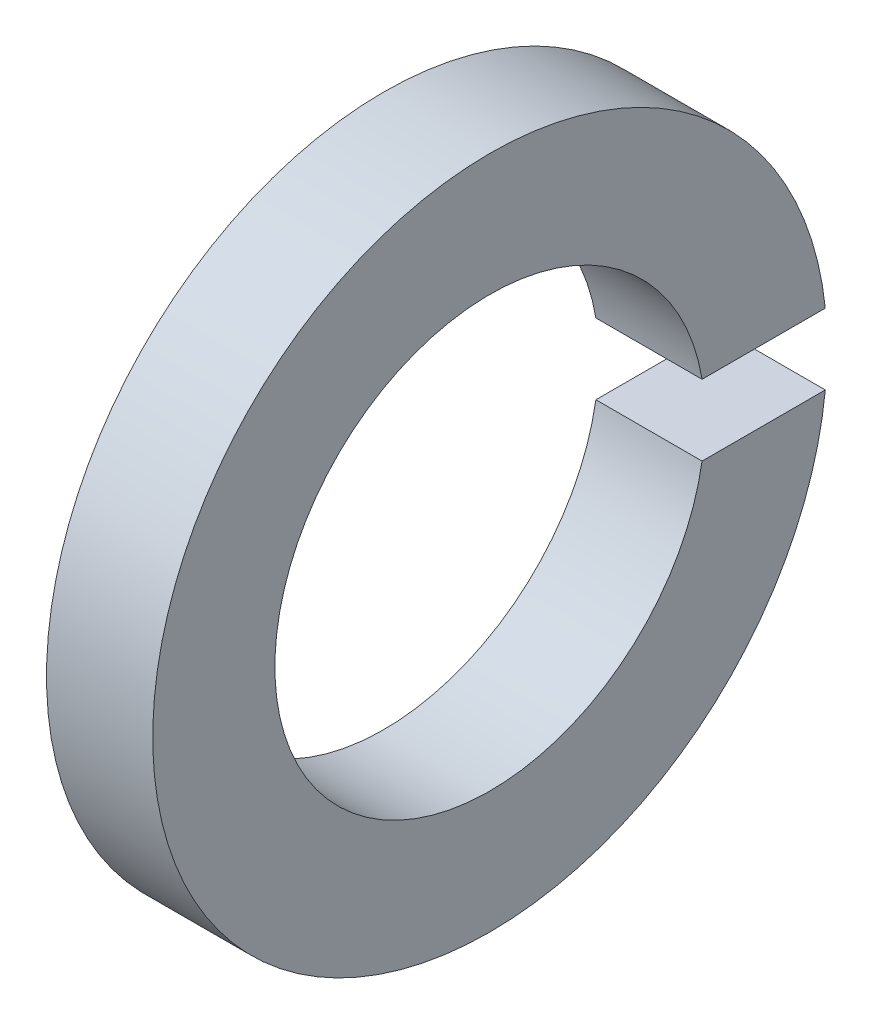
ISO-10303-21;
HEADER;
FILE_DESCRIPTION(('STEP AP214'),'2;1');
FILE_NAME('part.step','',(''),(''),'','','');
FILE_SCHEMA(('AUTOMOTIVE_DESIGN { 1 0 10303 214 1 1 1 1 }'));
ENDSEC;
DATA;
#1=APPLICATION_CONTEXT('core data for automotive mechanical design processes');
#2=APPLICATION_PROTOCOL_DEFINITION('international standard','automotive_design',2000,#1);
#3=PRODUCT_CONTEXT('',#1,'mechanical');
#4=PRODUCT('Part','Part','',(#3));
#5=PRODUCT_RELATED_PRODUCT_CATEGORY('part','',(#4));
#6=PRODUCT_DEFINITION_FORMATION('','',#4);
#7=PRODUCT_DEFINITION_CONTEXT('part definition',#1,'design');
#8=PRODUCT_DEFINITION('design','',#6,#7);
#9=PRODUCT_DEFINITION_SHAPE('','',#8);
#10=(LENGTH_UNIT() NAMED_UNIT(*) SI_UNIT(.MILLI.,.METRE.));
#11=(NAMED_UNIT(*) PLANE_ANGLE_UNIT() SI_UNIT($,.RADIAN.));
#12=(NAMED_UNIT(*) SI_UNIT($,.STERADIAN.) SOLID_ANGLE_UNIT());
#13=UNCERTAINTY_MEASURE_WITH_UNIT(LENGTH_MEASURE(1.E-05),#10,'distance_accuracy_value','');
#14=(GEOMETRIC_REPRESENTATION_CONTEXT(3) GLOBAL_UNCERTAINTY_ASSIGNED_CONTEXT((#13)) GLOBAL_UNIT_ASSIGNED_CONTEXT((#10,
#11,#12)) REPRESENTATION_CONTEXT('',''));
#15=CARTESIAN_POINT('',(0.,0.,0.));
#16=DIRECTION('',(0.,0.,1.));
#17=DIRECTION('',(1.,0.,0.));
#18=AXIS2_PLACEMENT_3D('',#15,#16,#17);
#19=CARTESIAN_POINT('',(-109.,-34.,69.9999999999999));
#20=DIRECTION('',(1.,0.,0.));
#21=DIRECTION('',(0.,0.,-1.));
#22=AXIS2_PLACEMENT_3D('',#19,#20,#21);
#23=CYLINDRICAL_SURFACE('',#22,6.35);
#24=CARTESIAN_POINT('',(-108.,-34.,69.9999999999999));
#25=DIRECTION('',(-1.,0.,0.));
#26=DIRECTION('',(0.,1.,0.));
#27=AXIS2_PLACEMENT_3D('',#24,#25,#26);
#28=CIRCLE('',#27,6.35);
#29=CARTESIAN_POINT('',(-108.,-34.6666666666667,63.6850925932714));
#30=VERTEX_POINT('',#29);
#31=CARTESIAN_POINT('',(-108.,-33.3333333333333,63.6850925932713));
#32=VERTEX_POINT('',#31);
#33=EDGE_CURVE('E9',#30,#32,#28,.T.);
#34=ORIENTED_EDGE('',*,*,#33,.T.);
#35=DIRECTION('',(-1.,0.,0.));
#36=VECTOR('',#35,1.);
#37=CARTESIAN_POINT('',(-109.,-33.3333333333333,63.6850925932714));
#38=LINE('',#37,#36);
#39=CARTESIAN_POINT('',(-110.,-33.3333333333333,63.6850925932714));
#40=VERTEX_POINT('',#39);
#41=EDGE_CURVE('E69',#32,#40,#38,.T.);
#42=ORIENTED_EDGE('',*,*,#41,.T.);
#43=CARTESIAN_POINT('',(-110.,-34.,69.9999999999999));
#44=DIRECTION('',(-1.,0.,0.));
#45=DIRECTION('',(0.,1.,0.));
#46=AXIS2_PLACEMENT_3D('',#43,#44,#45);
#47=CIRCLE('',#46,6.35);
#48=CARTESIAN_POINT('',(-110.,-34.6666666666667,63.6850925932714));
#49=VERTEX_POINT('',#48);
#50=EDGE_CURVE('E74',#49,#40,#47,.T.);
#51=ORIENTED_EDGE('',*,*,#50,.F.);
#52=DIRECTION('',(1.,0.,0.));
#53=VECTOR('',#52,1.);
#54=CARTESIAN_POINT('',(-109.,-34.6666666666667,63.6850925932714));
#55=LINE('',#54,#53);
#56=EDGE_CURVE('E97',#49,#30,#55,.T.);
#57=ORIENTED_EDGE('',*,*,#56,.T.);
#58=EDGE_LOOP('',(#34,#42,#51,#57));
#59=FACE_BOUND('',#58,.T.);
#60=ADVANCED_FACE('F14',(#59),#23,.T.);
#61=CARTESIAN_POINT('',(-108.,-28.8,69.9999999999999));
#62=DIRECTION('',(1.,0.,0.));
#63=DIRECTION('',(0.,0.,-1.));
#64=AXIS2_PLACEMENT_3D('',#61,#62,#63);
#65=PLANE('',#64);
#66=DIRECTION('',(0.,0.,-1.));
#67=VECTOR('',#66,1.);
#68=CARTESIAN_POINT('',(-108.,-33.3333333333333,69.9999999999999));
#69=LINE('',#68,#67);
#70=CARTESIAN_POINT('',(-108.,-33.3333333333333,66.0052464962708));
#71=VERTEX_POINT('',#70);
#72=EDGE_CURVE('E25',#71,#32,#69,.T.);
#73=ORIENTED_EDGE('',*,*,#72,.T.);
#74=ORIENTED_EDGE('',*,*,#33,.F.);
#75=DIRECTION('',(0.,0.,1.));
#76=VECTOR('',#75,1.);
#77=CARTESIAN_POINT('',(-108.,-34.6666666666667,69.9999999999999));
#78=LINE('',#77,#76);
#79=CARTESIAN_POINT('',(-108.,-34.6666666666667,66.0052464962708));
#80=VERTEX_POINT('',#79);
#81=EDGE_CURVE('E60',#30,#80,#78,.T.);
#82=ORIENTED_EDGE('',*,*,#81,.T.);
#83=CARTESIAN_POINT('',(-108.,-34.,69.9999999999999));
#84=DIRECTION('',(-1.,0.,0.));
#85=DIRECTION('',(0.,1.,0.));
#86=AXIS2_PLACEMENT_3D('',#83,#84,#85);
#87=CIRCLE('',#86,4.05);
#88=EDGE_CURVE('E52',#80,#71,#87,.T.);
#89=ORIENTED_EDGE('',*,*,#88,.T.);
#90=EDGE_LOOP('',(#73,#74,#82,#89));
#91=FACE_BOUND('',#90,.T.);
#92=ADVANCED_FACE('F58',(#91),#65,.T.);
#93=CARTESIAN_POINT('',(-110.,-28.8,69.9999999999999));
#94=DIRECTION('',(-1.,0.,0.));
#95=DIRECTION('',(0.,0.,1.));
#96=AXIS2_PLACEMENT_3D('',#93,#94,#95);
#97=PLANE('',#96);
#98=DIRECTION('',(0.,0.,1.));
#99=VECTOR('',#98,1.);
#100=CARTESIAN_POINT('',(-110.,-33.3333333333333,69.9999999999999));
#101=LINE('',#100,#99);
#102=CARTESIAN_POINT('',(-110.,-33.3333333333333,66.0052464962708));
#103=VERTEX_POINT('',#102);
#104=EDGE_CURVE('E62',#40,#103,#101,.T.);
#105=ORIENTED_EDGE('',*,*,#104,.T.);
#106=CARTESIAN_POINT('',(-110.,-34.,69.9999999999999));
#107=DIRECTION('',(-1.,0.,0.));
#108=DIRECTION('',(0.,1.,0.));
#109=AXIS2_PLACEMENT_3D('',#106,#107,#108);
#110=CIRCLE('',#109,4.05);
#111=CARTESIAN_POINT('',(-110.,-34.6666666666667,66.0052464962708));
#112=VERTEX_POINT('',#111);
#113=EDGE_CURVE('E72',#112,#103,#110,.T.);
#114=ORIENTED_EDGE('',*,*,#113,.F.);
#115=DIRECTION('',(0.,0.,-1.));
#116=VECTOR('',#115,1.);
#117=CARTESIAN_POINT('',(-110.,-34.6666666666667,69.9999999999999));
#118=LINE('',#117,#116);
#119=EDGE_CURVE('E81',#112,#49,#118,.T.);
#120=ORIENTED_EDGE('',*,*,#119,.T.);
#121=ORIENTED_EDGE('',*,*,#50,.T.);
#122=EDGE_LOOP('',(#105,#114,#120,#121));
#123=FACE_BOUND('',#122,.T.);
#124=ADVANCED_FACE('F101',(#123),#97,.T.);
#125=CARTESIAN_POINT('',(-109.,-34.,69.9999999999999));
#126=DIRECTION('',(1.,0.,0.));
#127=DIRECTION('',(0.,0.,-1.));
#128=AXIS2_PLACEMENT_3D('',#125,#126,#127);
#129=CYLINDRICAL_SURFACE('',#128,4.05);
#130=ORIENTED_EDGE('',*,*,#88,.F.);
#131=DIRECTION('',(-1.,0.,0.));
#132=VECTOR('',#131,1.);
#133=CARTESIAN_POINT('',(-109.,-34.6666666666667,66.0052464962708));
#134=LINE('',#133,#132);
#135=EDGE_CURVE('E75',#80,#112,#134,.T.);
#136=ORIENTED_EDGE('',*,*,#135,.T.);
#137=ORIENTED_EDGE('',*,*,#113,.T.);
#138=DIRECTION('',(1.,0.,0.));
#139=VECTOR('',#138,1.);
#140=CARTESIAN_POINT('',(-109.,-33.3333333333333,66.0052464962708));
#141=LINE('',#140,#139);
#142=EDGE_CURVE('E18',#103,#71,#141,.T.);
#143=ORIENTED_EDGE('',*,*,#142,.T.);
#144=EDGE_LOOP('',(#130,#136,#137,#143));
#145=FACE_BOUND('',#144,.T.);
#146=ADVANCED_FACE('F16',(#145),#129,.F.);
#147=CARTESIAN_POINT('',(-110.,-34.6666666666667,69.9999999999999));
#148=DIRECTION('',(0.,1.,0.));
#149=DIRECTION('',(0.,0.,1.));
#150=AXIS2_PLACEMENT_3D('',#147,#148,#149);
#151=PLANE('',#150);
#152=ORIENTED_EDGE('',*,*,#135,.F.);
#153=ORIENTED_EDGE('',*,*,#81,.F.);
#154=ORIENTED_EDGE('',*,*,#56,.F.);
#155=ORIENTED_EDGE('',*,*,#119,.F.);
#156=EDGE_LOOP('',(#152,#153,#154,#155));
#157=FACE_BOUND('',#156,.T.);
#158=ADVANCED_FACE('F108',(#157),#151,.T.);
#159=CARTESIAN_POINT('',(-108.,-33.3333333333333,69.9999999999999));
#160=DIRECTION('',(0.,-1.,0.));
#161=DIRECTION('',(0.,0.,-1.));
#162=AXIS2_PLACEMENT_3D('',#159,#160,#161);
#163=PLANE('',#162);
#164=ORIENTED_EDGE('',*,*,#41,.F.);
#165=ORIENTED_EDGE('',*,*,#72,.F.);
#166=ORIENTED_EDGE('',*,*,#142,.F.);
#167=ORIENTED_EDGE('',*,*,#104,.F.);
#168=EDGE_LOOP('',(#164,#165,#166,#167));
#169=FACE_BOUND('',#168,.T.);
#170=ADVANCED_FACE('F66',(#169),#163,.T.);
#171=CLOSED_SHELL('',(#60,#92,#124,#146,#158,#170));
#172=MANIFOLD_SOLID_BREP('B1',#171);
#173=ADVANCED_BREP_SHAPE_REPRESENTATION('',(#18,#172),#14);
#174=SHAPE_DEFINITION_REPRESENTATION(#9,#173);
ENDSEC;
END-ISO-10303-21;
